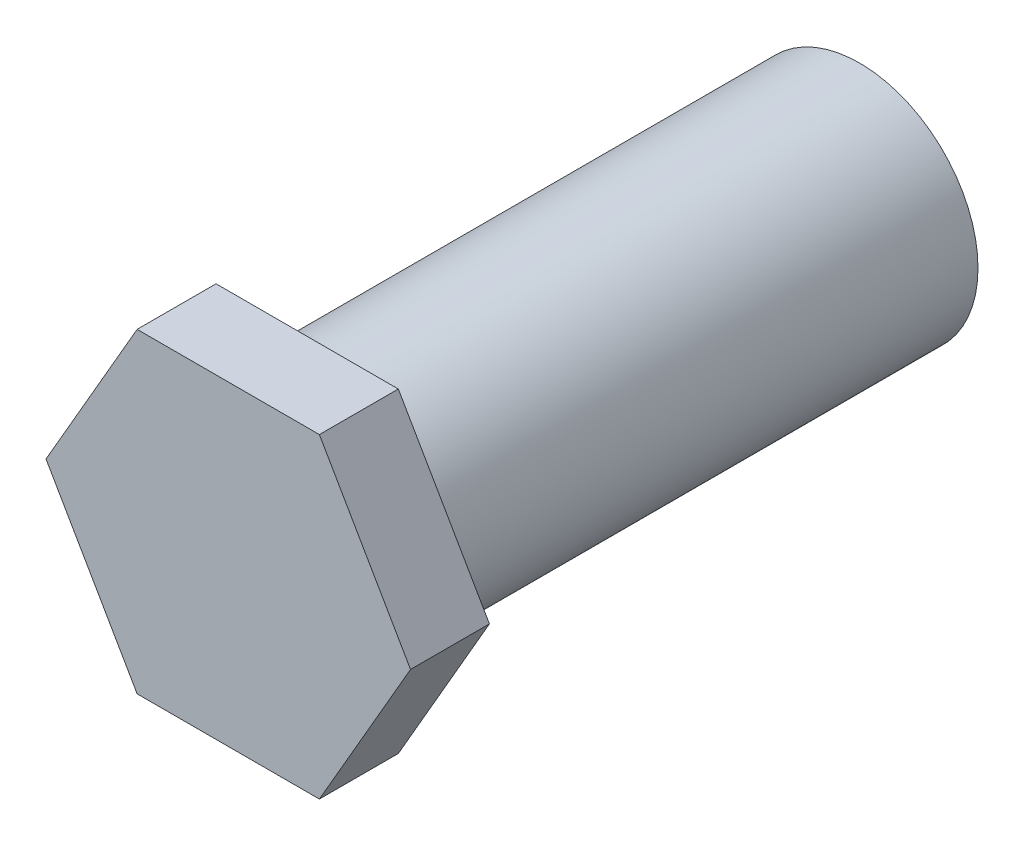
from build123d import *

# Parameters (mm, degrees)
SKETCH1_R      = 7.5
EXTRUDE1_DEPTH = 35
EXTRUDE2_DEPTH = 5


with BuildPart() as part:
    # Sketch1 → Extrude1 (new body)
    with BuildSketch(Plane.XY):
        Circle(SKETCH1_R)
    extrude(amount=EXTRUDE1_DEPTH)

    # Sketch2 → Extrude2 (add)
    with BuildSketch(Plane.XY.offset(35)):
        Polygon((11.547005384, 0), (5.773502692, 10), (-5.773502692, 10), (-11.547005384, 0), (-5.773502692, -10), (5.773502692, -10), align=None)
    extrude(amount=EXTRUDE2_DEPTH)


solid = part.part
